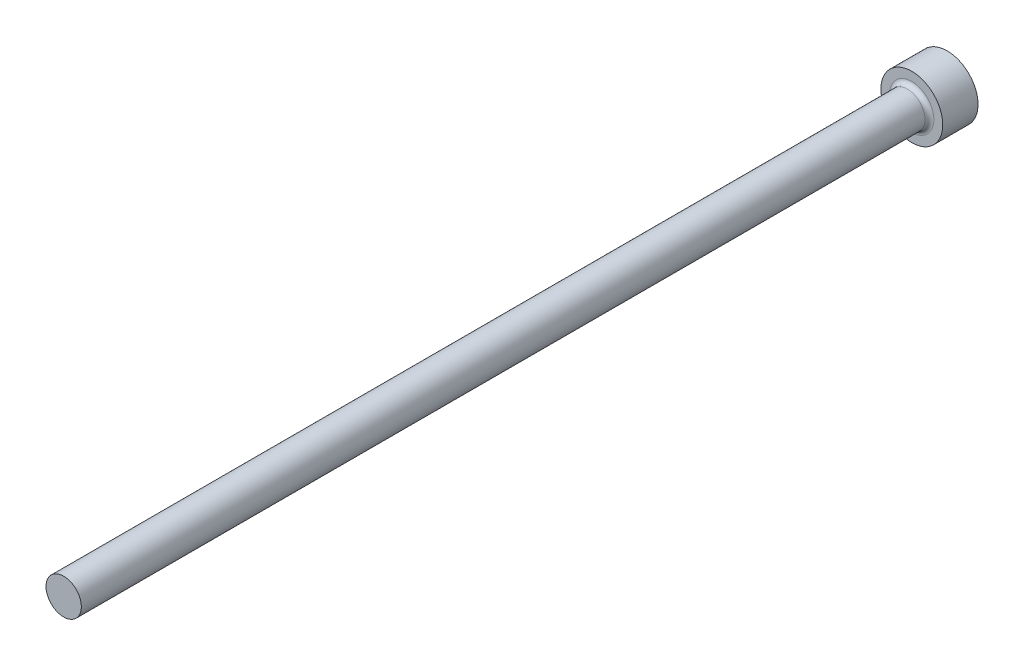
from build123d import *

# Parameters (mm, degrees)
FILLET1_R = 0.5


with BuildPart() as part:
    # FV → Revolve1 (revolve)
    with BuildSketch(Plane(origin=(0, 0, 0), x_dir=(1, 0, 0), z_dir=(0, 1, 0)), mode=Mode.PRIVATE) as revolve1_sk:
        Polygon((0, 0), (3.5, 0), (3.5, -4), (2, -4), (2, -100), (0, -100), align=None)
    revolve(revolve1_sk.sketch.rotate(Axis((0, 0, -9.033228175), (0, 0, 1)), 180), axis=Axis((0, 0, -9.033228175), (0, 0, 1)))

    # Fillet1
    fillet1_edges = [part.edges().sort_by_distance(p)[0] for p in [
        (2, 0, 4),
    ]]
    fillet(fillet1_edges, radius=FILLET1_R)


solid = part.part
